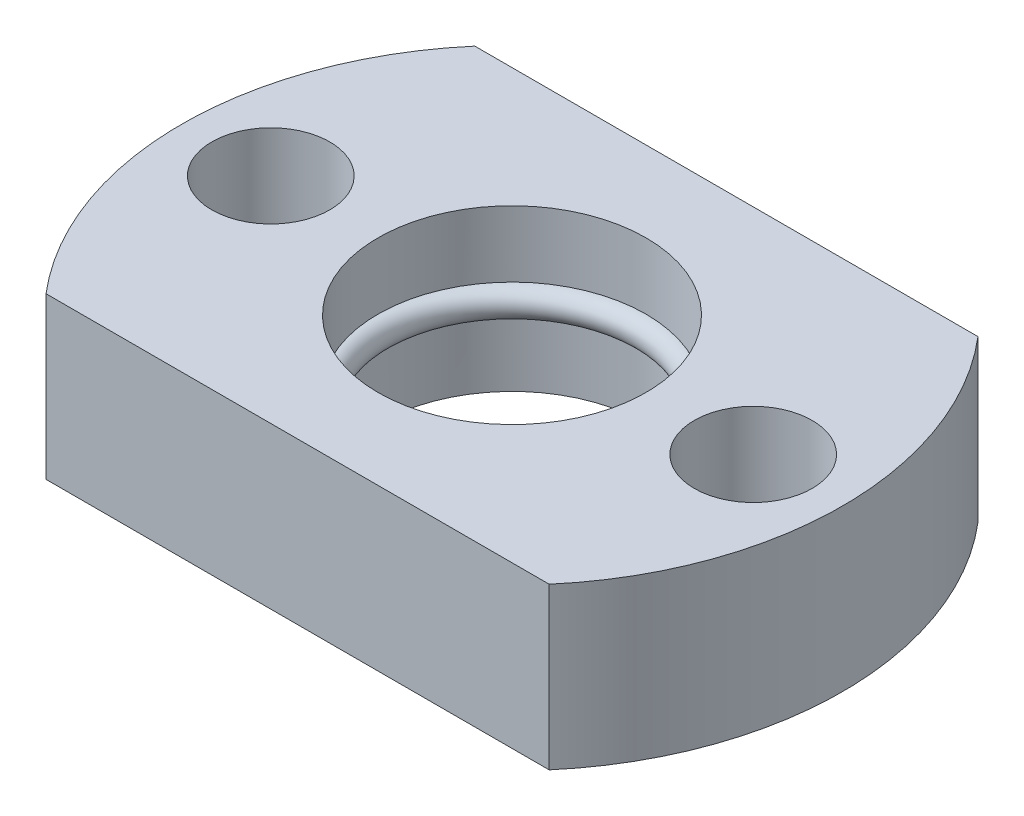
from build123d import *

# Parameters (mm, degrees)
SKETCH2_R           = 7.5
SKETCH2_R_2         = 3.3
BOSS_EXTRUDE1_DEPTH = 4.5
SKETCH3_R           = 0.8


with BuildPart() as part:
    # Sketch2 → Boss-Extrude1 (new, symmetric)
    with BuildSketch(Plane(origin=(0, 0, 0), x_dir=(1, 0, 0), z_dir=(0, 1, 0))):
        with BuildLine():
            Line((-14.08012784, 12), (14.08012784, 12))
            ThreePointArc((14.08012784, 12), (18.5, 0), (14.08012784, -12))
            Line((14.08012784, -12), (-14.08012784, -12))
            ThreePointArc((-14.08012784, -12), (-18.5, 0), (-14.08012784, 12))
        make_face()
        with Locations(Location((0, 0, 0), (0, 0, 270))):
            Circle(SKETCH2_R, mode=Mode.SUBTRACT)
        with Locations(Location((-13.5, 0, 0), (0, 0, 270))):
            Circle(SKETCH2_R_2, mode=Mode.SUBTRACT)
        with Locations(Location((13.5, 0, 0), (0, 0, 270))):
            Circle(SKETCH2_R_2, mode=Mode.SUBTRACT)
    extrude(amount=BOSS_EXTRUDE1_DEPTH, both=True)

    # Sketch3 → Revolve1 (revolve)
    with BuildSketch(Plane.XY, mode=Mode.PRIVATE) as revolve1_sk:
        with Locations((-7.5, 0)):
            Circle(SKETCH3_R)
    revolve(revolve1_sk.sketch.rotate(Axis((0, 0, 0), (0, 1, 0)), 270), axis=Axis((0, 0, 0), (0, 1, 0)))


solid = part.part
